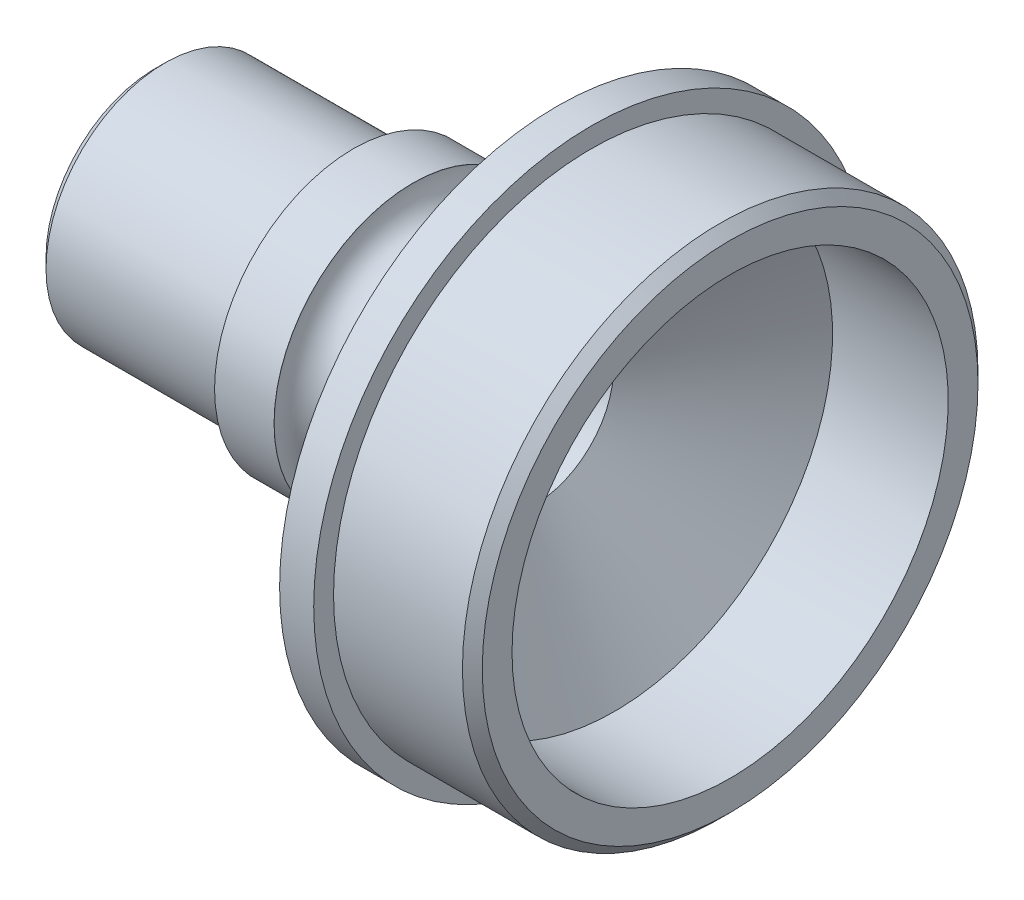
ISO-10303-21;
HEADER;
FILE_DESCRIPTION(('STEP AP214'),'2;1');
FILE_NAME('part.step','',(''),(''),'','','');
FILE_SCHEMA(('AUTOMOTIVE_DESIGN { 1 0 10303 214 1 1 1 1 }'));
ENDSEC;
DATA;
#1=APPLICATION_CONTEXT('core data for automotive mechanical design processes');
#2=APPLICATION_PROTOCOL_DEFINITION('international standard','automotive_design',2000,#1);
#3=PRODUCT_CONTEXT('',#1,'mechanical');
#4=PRODUCT('Part','Part','',(#3));
#5=PRODUCT_RELATED_PRODUCT_CATEGORY('part','',(#4));
#6=PRODUCT_DEFINITION_FORMATION('','',#4);
#7=PRODUCT_DEFINITION_CONTEXT('part definition',#1,'design');
#8=PRODUCT_DEFINITION('design','',#6,#7);
#9=PRODUCT_DEFINITION_SHAPE('','',#8);
#10=(LENGTH_UNIT() NAMED_UNIT(*) SI_UNIT(.MILLI.,.METRE.));
#11=(NAMED_UNIT(*) PLANE_ANGLE_UNIT() SI_UNIT($,.RADIAN.));
#12=(NAMED_UNIT(*) SI_UNIT($,.STERADIAN.) SOLID_ANGLE_UNIT());
#13=UNCERTAINTY_MEASURE_WITH_UNIT(LENGTH_MEASURE(1.E-05),#10,'distance_accuracy_value','');
#14=(GEOMETRIC_REPRESENTATION_CONTEXT(3) GLOBAL_UNCERTAINTY_ASSIGNED_CONTEXT((#13)) GLOBAL_UNIT_ASSIGNED_CONTEXT((#10,
#11,#12)) REPRESENTATION_CONTEXT('',''));
#15=CARTESIAN_POINT('',(0.,0.,0.));
#16=DIRECTION('',(0.,0.,1.));
#17=DIRECTION('',(1.,0.,0.));
#18=AXIS2_PLACEMENT_3D('',#15,#16,#17);
#19=CARTESIAN_POINT('',(-6.13336789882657,0.,0.));
#20=DIRECTION('',(1.,0.,0.));
#21=DIRECTION('',(0.,0.,-1.));
#22=AXIS2_PLACEMENT_3D('',#19,#20,#21);
#23=CONICAL_SURFACE('',#22,6.35604902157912,1.04719755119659);
#24=CARTESIAN_POINT('',(-1.72013074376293,0.,0.));
#25=DIRECTION('',(-1.,0.,0.));
#26=DIRECTION('',(0.,0.,1.));
#27=AXIS2_PLACEMENT_3D('',#24,#25,#26);
#28=CIRCLE('',#27,14.);
#29=CARTESIAN_POINT('',(-1.72013074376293,0.,14.));
#30=VERTEX_POINT('',#29);
#31=EDGE_CURVE('E85',#30,#30,#28,.T.);
#32=ORIENTED_EDGE('',*,*,#31,.T.);
#33=EDGE_LOOP('',(#32));
#34=FACE_BOUND('',#33,.T.);
#35=CARTESIAN_POINT('',(-6.13336789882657,0.,0.));
#36=DIRECTION('',(-1.,0.,0.));
#37=DIRECTION('',(0.,0.,1.));
#38=AXIS2_PLACEMENT_3D('',#35,#36,#37);
#39=CIRCLE('',#38,6.35604902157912);
#40=CARTESIAN_POINT('',(-6.13336789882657,0.,6.35604902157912));
#41=VERTEX_POINT('',#40);
#42=EDGE_CURVE('E49',#41,#41,#39,.T.);
#43=ORIENTED_EDGE('',*,*,#42,.F.);
#44=EDGE_LOOP('',(#43));
#45=FACE_BOUND('',#44,.T.);
#46=ADVANCED_FACE('F30',(#34,#45),#23,.T.);
#47=CARTESIAN_POINT('',(0.,0.,0.));
#48=DIRECTION('',(-1.,0.,0.));
#49=DIRECTION('',(0.,0.,1.));
#50=AXIS2_PLACEMENT_3D('',#47,#48,#49);
#51=CYLINDRICAL_SURFACE('',#50,6.35604902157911);
#52=ORIENTED_EDGE('',*,*,#42,.T.);
#53=EDGE_LOOP('',(#52));
#54=FACE_BOUND('',#53,.T.);
#55=CARTESIAN_POINT('',(-6.14007077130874,0.,0.));
#56=DIRECTION('',(-1.,0.,0.));
#57=DIRECTION('',(0.,0.,1.));
#58=AXIS2_PLACEMENT_3D('',#55,#56,#57);
#59=CIRCLE('',#58,6.35604902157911);
#60=CARTESIAN_POINT('',(-6.14007077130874,0.,6.35604902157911));
#61=VERTEX_POINT('',#60);
#62=EDGE_CURVE('E52',#61,#61,#59,.T.);
#63=ORIENTED_EDGE('',*,*,#62,.F.);
#64=EDGE_LOOP('',(#63));
#65=FACE_BOUND('',#64,.T.);
#66=ADVANCED_FACE('F108',(#54,#65),#51,.T.);
#67=CARTESIAN_POINT('',(-7.5,0.,0.));
#68=DIRECTION('',(-1.,0.,0.));
#69=DIRECTION('',(0.,0.,1.));
#70=AXIS2_PLACEMENT_3D('',#67,#68,#69);
#71=TOROIDAL_SURFACE('',#70,6.98897278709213,1.5);
#72=ORIENTED_EDGE('',*,*,#62,.T.);
#73=EDGE_LOOP('',(#72));
#74=FACE_BOUND('',#73,.T.);
#75=CARTESIAN_POINT('',(-9.,0.,0.));
#76=DIRECTION('',(-1.,0.,0.));
#77=DIRECTION('',(0.,0.,1.));
#78=AXIS2_PLACEMENT_3D('',#75,#76,#77);
#79=CIRCLE('',#78,6.98897278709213);
#80=CARTESIAN_POINT('',(-9.,0.,6.98897278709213));
#81=VERTEX_POINT('',#80);
#82=EDGE_CURVE('E55',#81,#81,#79,.T.);
#83=ORIENTED_EDGE('',*,*,#82,.F.);
#84=EDGE_LOOP('',(#83));
#85=FACE_BOUND('',#84,.T.);
#86=ADVANCED_FACE('F112',(#74,#85),#71,.F.);
#87=CARTESIAN_POINT('',(-9.,7.,0.));
#88=DIRECTION('',(1.,0.,0.));
#89=DIRECTION('',(0.,0.,-1.));
#90=AXIS2_PLACEMENT_3D('',#87,#88,#89);
#91=PLANE('',#90);
#92=ORIENTED_EDGE('',*,*,#82,.T.);
#93=EDGE_LOOP('',(#92));
#94=FACE_BOUND('',#93,.T.);
#95=CARTESIAN_POINT('',(-9.,0.,0.));
#96=DIRECTION('',(-1.,0.,0.));
#97=DIRECTION('',(0.,0.,1.));
#98=AXIS2_PLACEMENT_3D('',#95,#96,#97);
#99=CIRCLE('',#98,7.);
#100=CARTESIAN_POINT('',(-9.,0.,7.));
#101=VERTEX_POINT('',#100);
#102=EDGE_CURVE('E58',#101,#101,#99,.T.);
#103=ORIENTED_EDGE('',*,*,#102,.F.);
#104=EDGE_LOOP('',(#103));
#105=FACE_BOUND('',#104,.T.);
#106=ADVANCED_FACE('F117',(#94,#105),#91,.T.);
#107=CARTESIAN_POINT('',(0.,0.,0.));
#108=DIRECTION('',(-1.,0.,0.));
#109=DIRECTION('',(0.,0.,1.));
#110=AXIS2_PLACEMENT_3D('',#107,#108,#109);
#111=CYLINDRICAL_SURFACE('',#110,7.);
#112=ORIENTED_EDGE('',*,*,#102,.T.);
#113=EDGE_LOOP('',(#112));
#114=FACE_BOUND('',#113,.T.);
#115=CARTESIAN_POINT('',(-12.,0.,0.));
#116=DIRECTION('',(-1.,0.,0.));
#117=DIRECTION('',(0.,0.,1.));
#118=AXIS2_PLACEMENT_3D('',#115,#116,#117);
#119=CIRCLE('',#118,7.);
#120=CARTESIAN_POINT('',(-12.,0.,7.));
#121=VERTEX_POINT('',#120);
#122=EDGE_CURVE('E61',#121,#121,#119,.T.);
#123=ORIENTED_EDGE('',*,*,#122,.F.);
#124=EDGE_LOOP('',(#123));
#125=FACE_BOUND('',#124,.T.);
#126=ADVANCED_FACE('F124',(#114,#125),#111,.T.);
#127=CARTESIAN_POINT('',(-12.,6.,0.));
#128=DIRECTION('',(-1.,0.,0.));
#129=DIRECTION('',(0.,0.,1.));
#130=AXIS2_PLACEMENT_3D('',#127,#128,#129);
#131=PLANE('',#130);
#132=ORIENTED_EDGE('',*,*,#122,.T.);
#133=EDGE_LOOP('',(#132));
#134=FACE_BOUND('',#133,.T.);
#135=CARTESIAN_POINT('',(-12.,0.,0.));
#136=DIRECTION('',(-1.,0.,0.));
#137=DIRECTION('',(0.,0.,1.));
#138=AXIS2_PLACEMENT_3D('',#135,#136,#137);
#139=CIRCLE('',#138,6.);
#140=CARTESIAN_POINT('',(-12.,0.,6.));
#141=VERTEX_POINT('',#140);
#142=EDGE_CURVE('E64',#141,#141,#139,.T.);
#143=ORIENTED_EDGE('',*,*,#142,.F.);
#144=EDGE_LOOP('',(#143));
#145=FACE_BOUND('',#144,.T.);
#146=ADVANCED_FACE('F128',(#134,#145),#131,.T.);
#147=CARTESIAN_POINT('',(0.,0.,0.));
#148=DIRECTION('',(-1.,0.,0.));
#149=DIRECTION('',(0.,0.,1.));
#150=AXIS2_PLACEMENT_3D('',#147,#148,#149);
#151=CYLINDRICAL_SURFACE('',#150,6.);
#152=CARTESIAN_POINT('',(-21.5,0.,0.));
#153=DIRECTION('',(-1.,0.,0.));
#154=DIRECTION('',(0.,0.,1.));
#155=AXIS2_PLACEMENT_3D('',#152,#153,#154);
#156=CIRCLE('',#155,6.);
#157=CARTESIAN_POINT('',(-21.5,0.,6.));
#158=VERTEX_POINT('',#157);
#159=EDGE_CURVE('E10',#158,#158,#156,.F.);
#160=ORIENTED_EDGE('',*,*,#159,.T.);
#161=EDGE_LOOP('',(#160));
#162=FACE_BOUND('',#161,.T.);
#163=ORIENTED_EDGE('',*,*,#142,.T.);
#164=EDGE_LOOP('',(#163));
#165=FACE_BOUND('',#164,.T.);
#166=ADVANCED_FACE('F132',(#162,#165),#151,.T.);
#167=CARTESIAN_POINT('',(-22.,4.,0.));
#168=DIRECTION('',(-1.,0.,0.));
#169=DIRECTION('',(0.,0.,1.));
#170=AXIS2_PLACEMENT_3D('',#167,#168,#169);
#171=PLANE('',#170);
#172=CARTESIAN_POINT('',(-22.,0.,0.));
#173=DIRECTION('',(-1.,0.,0.));
#174=DIRECTION('',(0.,0.,1.));
#175=AXIS2_PLACEMENT_3D('',#172,#173,#174);
#176=CIRCLE('',#175,5.49999999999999);
#177=CARTESIAN_POINT('',(-22.,0.,5.49999999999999));
#178=VERTEX_POINT('',#177);
#179=EDGE_CURVE('E36',#178,#178,#176,.T.);
#180=ORIENTED_EDGE('',*,*,#179,.T.);
#181=EDGE_LOOP('',(#180));
#182=FACE_BOUND('',#181,.T.);
#183=CARTESIAN_POINT('',(-22.,0.,0.));
#184=DIRECTION('',(-1.,0.,0.));
#185=DIRECTION('',(0.,0.,1.));
#186=AXIS2_PLACEMENT_3D('',#183,#184,#185);
#187=CIRCLE('',#186,4.);
#188=CARTESIAN_POINT('',(-22.,0.,4.));
#189=VERTEX_POINT('',#188);
#190=EDGE_CURVE('E67',#189,#189,#187,.T.);
#191=ORIENTED_EDGE('',*,*,#190,.F.);
#192=EDGE_LOOP('',(#191));
#193=FACE_BOUND('',#192,.T.);
#194=ADVANCED_FACE('F136',(#182,#193),#171,.T.);
#195=CARTESIAN_POINT('',(0.,0.,0.));
#196=DIRECTION('',(-1.,0.,0.));
#197=DIRECTION('',(0.,0.,1.));
#198=AXIS2_PLACEMENT_3D('',#195,#196,#197);
#199=CYLINDRICAL_SURFACE('',#198,4.);
#200=ORIENTED_EDGE('',*,*,#190,.T.);
#201=EDGE_LOOP('',(#200));
#202=FACE_BOUND('',#201,.T.);
#203=CARTESIAN_POINT('',(-2.87483128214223,0.,0.));
#204=DIRECTION('',(-1.,0.,0.));
#205=DIRECTION('',(0.,0.,1.));
#206=AXIS2_PLACEMENT_3D('',#203,#204,#205);
#207=CIRCLE('',#206,4.);
#208=CARTESIAN_POINT('',(-2.87483128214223,0.,4.));
#209=VERTEX_POINT('',#208);
#210=EDGE_CURVE('E70',#209,#209,#207,.T.);
#211=ORIENTED_EDGE('',*,*,#210,.F.);
#212=EDGE_LOOP('',(#211));
#213=FACE_BOUND('',#212,.T.);
#214=ADVANCED_FACE('F139',(#202,#213),#199,.F.);
#215=CARTESIAN_POINT('',(1.16662060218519,0.,0.));
#216=DIRECTION('',(1.,0.,0.));
#217=DIRECTION('',(0.,0.,-1.));
#218=AXIS2_PLACEMENT_3D('',#215,#216,#217);
#219=CONICAL_SURFACE('',#218,11.,1.04719755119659);
#220=ORIENTED_EDGE('',*,*,#210,.T.);
#221=EDGE_LOOP('',(#220));
#222=FACE_BOUND('',#221,.T.);
#223=CARTESIAN_POINT('',(1.16662060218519,0.,0.));
#224=DIRECTION('',(-1.,0.,0.));
#225=DIRECTION('',(0.,0.,1.));
#226=AXIS2_PLACEMENT_3D('',#223,#224,#225);
#227=CIRCLE('',#226,11.);
#228=CARTESIAN_POINT('',(1.16662060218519,0.,11.));
#229=VERTEX_POINT('',#228);
#230=EDGE_CURVE('E73',#229,#229,#227,.T.);
#231=ORIENTED_EDGE('',*,*,#230,.F.);
#232=EDGE_LOOP('',(#231));
#233=FACE_BOUND('',#232,.T.);
#234=ADVANCED_FACE('F142',(#222,#233),#219,.F.);
#235=CARTESIAN_POINT('',(0.,0.,0.));
#236=DIRECTION('',(-1.,0.,0.));
#237=DIRECTION('',(0.,0.,1.));
#238=AXIS2_PLACEMENT_3D('',#235,#236,#237);
#239=CYLINDRICAL_SURFACE('',#238,11.);
#240=ORIENTED_EDGE('',*,*,#230,.T.);
#241=EDGE_LOOP('',(#240));
#242=FACE_BOUND('',#241,.T.);
#243=CARTESIAN_POINT('',(7.,0.,0.));
#244=DIRECTION('',(-1.,0.,0.));
#245=DIRECTION('',(0.,0.,1.));
#246=AXIS2_PLACEMENT_3D('',#243,#244,#245);
#247=CIRCLE('',#246,11.);
#248=CARTESIAN_POINT('',(7.,0.,11.));
#249=VERTEX_POINT('',#248);
#250=EDGE_CURVE('E76',#249,#249,#247,.T.);
#251=ORIENTED_EDGE('',*,*,#250,.F.);
#252=EDGE_LOOP('',(#251));
#253=FACE_BOUND('',#252,.T.);
#254=ADVANCED_FACE('F146',(#242,#253),#239,.F.);
#255=CARTESIAN_POINT('',(7.,13.,0.));
#256=DIRECTION('',(1.,0.,0.));
#257=DIRECTION('',(0.,0.,-1.));
#258=AXIS2_PLACEMENT_3D('',#255,#256,#257);
#259=PLANE('',#258);
#260=CARTESIAN_POINT('',(7.,0.,0.));
#261=DIRECTION('',(1.,0.,0.));
#262=DIRECTION('',(0.,0.,-1.));
#263=AXIS2_PLACEMENT_3D('',#260,#261,#262);
#264=CIRCLE('',#263,12.5);
#265=CARTESIAN_POINT('',(7.,0.,-12.5));
#266=VERTEX_POINT('',#265);
#267=EDGE_CURVE('E40',#266,#266,#264,.T.);
#268=ORIENTED_EDGE('',*,*,#267,.T.);
#269=EDGE_LOOP('',(#268));
#270=FACE_BOUND('',#269,.T.);
#271=ORIENTED_EDGE('',*,*,#250,.T.);
#272=EDGE_LOOP('',(#271));
#273=FACE_BOUND('',#272,.T.);
#274=ADVANCED_FACE('F150',(#270,#273),#259,.T.);
#275=CARTESIAN_POINT('',(0.,0.,0.));
#276=DIRECTION('',(-1.,0.,0.));
#277=DIRECTION('',(0.,0.,1.));
#278=AXIS2_PLACEMENT_3D('',#275,#276,#277);
#279=CYLINDRICAL_SURFACE('',#278,13.);
#280=CARTESIAN_POINT('',(6.49999999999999,0.,0.));
#281=DIRECTION('',(1.,0.,0.));
#282=DIRECTION('',(0.,0.,-1.));
#283=AXIS2_PLACEMENT_3D('',#280,#281,#282);
#284=CIRCLE('',#283,13.);
#285=CARTESIAN_POINT('',(6.49999999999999,0.,-13.));
#286=VERTEX_POINT('',#285);
#287=EDGE_CURVE('E44',#286,#286,#284,.F.);
#288=ORIENTED_EDGE('',*,*,#287,.T.);
#289=EDGE_LOOP('',(#288));
#290=FACE_BOUND('',#289,.T.);
#291=CARTESIAN_POINT('',(0.,0.,0.));
#292=DIRECTION('',(-1.,0.,0.));
#293=DIRECTION('',(0.,0.,1.));
#294=AXIS2_PLACEMENT_3D('',#291,#292,#293);
#295=CIRCLE('',#294,13.);
#296=CARTESIAN_POINT('',(0.,0.,13.));
#297=VERTEX_POINT('',#296);
#298=EDGE_CURVE('E79',#297,#297,#295,.T.);
#299=ORIENTED_EDGE('',*,*,#298,.F.);
#300=EDGE_LOOP('',(#299));
#301=FACE_BOUND('',#300,.T.);
#302=ADVANCED_FACE('F104',(#290,#301),#279,.T.);
#303=CARTESIAN_POINT('',(0.,14.,0.));
#304=DIRECTION('',(1.,0.,0.));
#305=DIRECTION('',(0.,0.,-1.));
#306=AXIS2_PLACEMENT_3D('',#303,#304,#305);
#307=PLANE('',#306);
#308=ORIENTED_EDGE('',*,*,#298,.T.);
#309=EDGE_LOOP('',(#308));
#310=FACE_BOUND('',#309,.T.);
#311=CARTESIAN_POINT('',(0.,0.,0.));
#312=DIRECTION('',(-1.,0.,0.));
#313=DIRECTION('',(0.,0.,1.));
#314=AXIS2_PLACEMENT_3D('',#311,#312,#313);
#315=CIRCLE('',#314,14.);
#316=CARTESIAN_POINT('',(0.,0.,14.));
#317=VERTEX_POINT('',#316);
#318=EDGE_CURVE('E82',#317,#317,#315,.T.);
#319=ORIENTED_EDGE('',*,*,#318,.F.);
#320=EDGE_LOOP('',(#319));
#321=FACE_BOUND('',#320,.T.);
#322=ADVANCED_FACE('F94',(#310,#321),#307,.T.);
#323=CARTESIAN_POINT('',(0.,0.,0.));
#324=DIRECTION('',(-1.,0.,0.));
#325=DIRECTION('',(0.,0.,1.));
#326=AXIS2_PLACEMENT_3D('',#323,#324,#325);
#327=CYLINDRICAL_SURFACE('',#326,14.);
#328=ORIENTED_EDGE('',*,*,#318,.T.);
#329=EDGE_LOOP('',(#328));
#330=FACE_BOUND('',#329,.T.);
#331=ORIENTED_EDGE('',*,*,#31,.F.);
#332=EDGE_LOOP('',(#331));
#333=FACE_BOUND('',#332,.T.);
#334=ADVANCED_FACE('F91',(#330,#333),#327,.T.);
#335=CARTESIAN_POINT('',(6.49999999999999,0.,0.));
#336=DIRECTION('',(-1.,0.,0.));
#337=DIRECTION('',(0.,0.,1.));
#338=AXIS2_PLACEMENT_3D('',#335,#336,#337);
#339=CONICAL_SURFACE('',#338,13.,0.785398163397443);
#340=ORIENTED_EDGE('',*,*,#267,.F.);
#341=EDGE_LOOP('',(#340));
#342=FACE_BOUND('',#341,.T.);
#343=ORIENTED_EDGE('',*,*,#287,.F.);
#344=EDGE_LOOP('',(#343));
#345=FACE_BOUND('',#344,.T.);
#346=ADVANCED_FACE('F93',(#342,#345),#339,.T.);
#347=CARTESIAN_POINT('',(-22.,0.,0.));
#348=DIRECTION('',(1.,0.,0.));
#349=DIRECTION('',(0.,0.,-1.));
#350=AXIS2_PLACEMENT_3D('',#347,#348,#349);
#351=CONICAL_SURFACE('',#350,5.49999999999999,0.785398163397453);
#352=ORIENTED_EDGE('',*,*,#159,.F.);
#353=EDGE_LOOP('',(#352));
#354=FACE_BOUND('',#353,.T.);
#355=ORIENTED_EDGE('',*,*,#179,.F.);
#356=EDGE_LOOP('',(#355));
#357=FACE_BOUND('',#356,.T.);
#358=ADVANCED_FACE('F101',(#354,#357),#351,.T.);
#359=CLOSED_SHELL('',(#46,#66,#86,#106,#126,#146,#166,#194,#214,#234,#254,#274,#302,#322,#334,
#346,#358));
#360=MANIFOLD_SOLID_BREP('B2',#359);
#361=ADVANCED_BREP_SHAPE_REPRESENTATION('',(#18,#360),#14);
#362=SHAPE_DEFINITION_REPRESENTATION(#9,#361);
ENDSEC;
END-ISO-10303-21;
